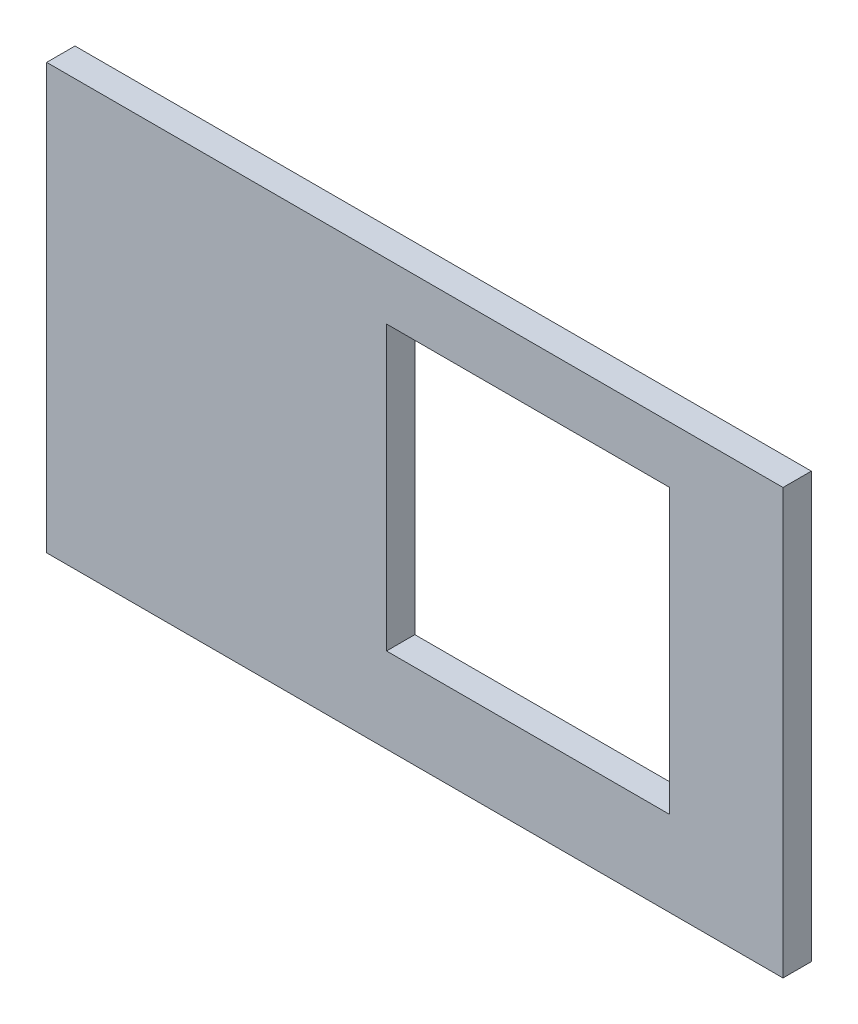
ISO-10303-21;
HEADER;
FILE_DESCRIPTION(('STEP AP214'),'2;1');
FILE_NAME('part.step','',(''),(''),'','','');
FILE_SCHEMA(('AUTOMOTIVE_DESIGN { 1 0 10303 214 1 1 1 1 }'));
ENDSEC;
DATA;
#1=APPLICATION_CONTEXT('core data for automotive mechanical design processes');
#2=APPLICATION_PROTOCOL_DEFINITION('international standard','automotive_design',2000,#1);
#3=PRODUCT_CONTEXT('',#1,'mechanical');
#4=PRODUCT('Part','Part','',(#3));
#5=PRODUCT_RELATED_PRODUCT_CATEGORY('part','',(#4));
#6=PRODUCT_DEFINITION_FORMATION('','',#4);
#7=PRODUCT_DEFINITION_CONTEXT('part definition',#1,'design');
#8=PRODUCT_DEFINITION('design','',#6,#7);
#9=PRODUCT_DEFINITION_SHAPE('','',#8);
#10=(LENGTH_UNIT() NAMED_UNIT(*) SI_UNIT(.MILLI.,.METRE.));
#11=(NAMED_UNIT(*) PLANE_ANGLE_UNIT() SI_UNIT($,.RADIAN.));
#12=(NAMED_UNIT(*) SI_UNIT($,.STERADIAN.) SOLID_ANGLE_UNIT());
#13=UNCERTAINTY_MEASURE_WITH_UNIT(LENGTH_MEASURE(1.E-05),#10,'distance_accuracy_value','');
#14=(GEOMETRIC_REPRESENTATION_CONTEXT(3) GLOBAL_UNCERTAINTY_ASSIGNED_CONTEXT((#13)) GLOBAL_UNIT_ASSIGNED_CONTEXT((#10,
#11,#12)) REPRESENTATION_CONTEXT('',''));
#15=CARTESIAN_POINT('',(0.,0.,0.));
#16=DIRECTION('',(0.,0.,1.));
#17=DIRECTION('',(1.,0.,0.));
#18=AXIS2_PLACEMENT_3D('',#15,#16,#17);
#19=CARTESIAN_POINT('',(0.,30.,2.));
#20=DIRECTION('',(0.,0.,-1.));
#21=DIRECTION('',(-1.,0.,0.));
#22=AXIS2_PLACEMENT_3D('',#19,#20,#21);
#23=PLANE('',#22);
#24=DIRECTION('',(0.,-1.,0.));
#25=VECTOR('',#24,1.);
#26=CARTESIAN_POINT('',(0.,0.,2.));
#27=LINE('',#26,#25);
#28=CARTESIAN_POINT('',(0.,30.,2.));
#29=VERTEX_POINT('',#28);
#30=CARTESIAN_POINT('',(0.,0.,2.));
#31=VERTEX_POINT('',#30);
#32=EDGE_CURVE('E139',#29,#31,#27,.T.);
#33=ORIENTED_EDGE('',*,*,#32,.T.);
#34=DIRECTION('',(1.,0.,0.));
#35=VECTOR('',#34,1.);
#36=CARTESIAN_POINT('',(0.,0.,2.));
#37=LINE('',#36,#35);
#38=CARTESIAN_POINT('',(52.,0.,2.));
#39=VERTEX_POINT('',#38);
#40=EDGE_CURVE('E142',#31,#39,#37,.T.);
#41=ORIENTED_EDGE('',*,*,#40,.T.);
#42=DIRECTION('',(0.,1.,0.));
#43=VECTOR('',#42,1.);
#44=CARTESIAN_POINT('',(52.,0.,2.));
#45=LINE('',#44,#43);
#46=CARTESIAN_POINT('',(52.,30.,2.));
#47=VERTEX_POINT('',#46);
#48=EDGE_CURVE('E144',#39,#47,#45,.T.);
#49=ORIENTED_EDGE('',*,*,#48,.T.);
#50=DIRECTION('',(-1.,0.,0.));
#51=VECTOR('',#50,1.);
#52=CARTESIAN_POINT('',(0.,30.,2.));
#53=LINE('',#52,#51);
#54=EDGE_CURVE('E146',#47,#29,#53,.T.);
#55=ORIENTED_EDGE('',*,*,#54,.T.);
#56=EDGE_LOOP('',(#33,#41,#49,#55));
#57=FACE_BOUND('',#56,.T.);
#58=DIRECTION('',(0.,-1.,0.));
#59=VECTOR('',#58,1.);
#60=CARTESIAN_POINT('',(24.,26.,2.));
#61=LINE('',#60,#59);
#62=CARTESIAN_POINT('',(24.,26.,2.));
#63=VERTEX_POINT('',#62);
#64=CARTESIAN_POINT('',(24.,5.99999999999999,2.));
#65=VERTEX_POINT('',#64);
#66=EDGE_CURVE('E110',#63,#65,#61,.T.);
#67=ORIENTED_EDGE('',*,*,#66,.F.);
#68=DIRECTION('',(-1.,0.,0.));
#69=VECTOR('',#68,1.);
#70=CARTESIAN_POINT('',(24.,26.,2.));
#71=LINE('',#70,#69);
#72=CARTESIAN_POINT('',(44.,26.,2.));
#73=VERTEX_POINT('',#72);
#74=EDGE_CURVE('E125',#73,#63,#71,.T.);
#75=ORIENTED_EDGE('',*,*,#74,.F.);
#76=DIRECTION('',(0.,1.,0.));
#77=VECTOR('',#76,1.);
#78=CARTESIAN_POINT('',(44.,26.,2.));
#79=LINE('',#78,#77);
#80=CARTESIAN_POINT('',(44.,5.99999999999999,2.));
#81=VERTEX_POINT('',#80);
#82=EDGE_CURVE('E123',#81,#73,#79,.T.);
#83=ORIENTED_EDGE('',*,*,#82,.F.);
#84=DIRECTION('',(1.,0.,0.));
#85=VECTOR('',#84,1.);
#86=CARTESIAN_POINT('',(24.,5.99999999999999,2.));
#87=LINE('',#86,#85);
#88=EDGE_CURVE('E121',#65,#81,#87,.T.);
#89=ORIENTED_EDGE('',*,*,#88,.F.);
#90=EDGE_LOOP('',(#67,#75,#83,#89));
#91=FACE_BOUND('',#90,.T.);
#92=ADVANCED_FACE('F30',(#57,#91),#23,.F.);
#93=CARTESIAN_POINT('',(0.,30.,0.));
#94=DIRECTION('',(0.,0.,-1.));
#95=DIRECTION('',(-1.,0.,0.));
#96=AXIS2_PLACEMENT_3D('',#93,#94,#95);
#97=PLANE('',#96);
#98=DIRECTION('',(0.,-1.,0.));
#99=VECTOR('',#98,1.);
#100=CARTESIAN_POINT('',(0.,0.,0.));
#101=LINE('',#100,#99);
#102=CARTESIAN_POINT('',(0.,30.,0.));
#103=VERTEX_POINT('',#102);
#104=CARTESIAN_POINT('',(0.,0.,0.));
#105=VERTEX_POINT('',#104);
#106=EDGE_CURVE('E111',#103,#105,#101,.T.);
#107=ORIENTED_EDGE('',*,*,#106,.F.);
#108=DIRECTION('',(-1.,0.,0.));
#109=VECTOR('',#108,1.);
#110=CARTESIAN_POINT('',(0.,30.,0.));
#111=LINE('',#110,#109);
#112=CARTESIAN_POINT('',(52.,30.,0.));
#113=VERTEX_POINT('',#112);
#114=EDGE_CURVE('E137',#113,#103,#111,.T.);
#115=ORIENTED_EDGE('',*,*,#114,.F.);
#116=DIRECTION('',(0.,1.,0.));
#117=VECTOR('',#116,1.);
#118=CARTESIAN_POINT('',(52.,0.,0.));
#119=LINE('',#118,#117);
#120=CARTESIAN_POINT('',(52.,0.,0.));
#121=VERTEX_POINT('',#120);
#122=EDGE_CURVE('E135',#121,#113,#119,.T.);
#123=ORIENTED_EDGE('',*,*,#122,.F.);
#124=DIRECTION('',(1.,0.,0.));
#125=VECTOR('',#124,1.);
#126=CARTESIAN_POINT('',(0.,0.,0.));
#127=LINE('',#126,#125);
#128=EDGE_CURVE('E133',#105,#121,#127,.T.);
#129=ORIENTED_EDGE('',*,*,#128,.F.);
#130=EDGE_LOOP('',(#107,#115,#123,#129));
#131=FACE_BOUND('',#130,.T.);
#132=DIRECTION('',(-1.,0.,0.));
#133=VECTOR('',#132,1.);
#134=CARTESIAN_POINT('',(24.,26.,0.));
#135=LINE('',#134,#133);
#136=CARTESIAN_POINT('',(44.,26.,0.));
#137=VERTEX_POINT('',#136);
#138=CARTESIAN_POINT('',(24.,26.,0.));
#139=VERTEX_POINT('',#138);
#140=EDGE_CURVE('E115',#137,#139,#135,.T.);
#141=ORIENTED_EDGE('',*,*,#140,.T.);
#142=DIRECTION('',(0.,-1.,0.));
#143=VECTOR('',#142,1.);
#144=CARTESIAN_POINT('',(24.,26.,0.));
#145=LINE('',#144,#143);
#146=CARTESIAN_POINT('',(24.,5.99999999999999,0.));
#147=VERTEX_POINT('',#146);
#148=EDGE_CURVE('E53',#139,#147,#145,.T.);
#149=ORIENTED_EDGE('',*,*,#148,.T.);
#150=DIRECTION('',(1.,0.,0.));
#151=VECTOR('',#150,1.);
#152=CARTESIAN_POINT('',(24.,5.99999999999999,0.));
#153=LINE('',#152,#151);
#154=CARTESIAN_POINT('',(44.,5.99999999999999,0.));
#155=VERTEX_POINT('',#154);
#156=EDGE_CURVE('E97',#147,#155,#153,.T.);
#157=ORIENTED_EDGE('',*,*,#156,.T.);
#158=DIRECTION('',(0.,1.,0.));
#159=VECTOR('',#158,1.);
#160=CARTESIAN_POINT('',(44.,26.,0.));
#161=LINE('',#160,#159);
#162=EDGE_CURVE('E106',#155,#137,#161,.T.);
#163=ORIENTED_EDGE('',*,*,#162,.T.);
#164=EDGE_LOOP('',(#141,#149,#157,#163));
#165=FACE_BOUND('',#164,.T.);
#166=ADVANCED_FACE('F114',(#131,#165),#97,.T.);
#167=CARTESIAN_POINT('',(0.,0.,2.));
#168=DIRECTION('',(1.,0.,0.));
#169=DIRECTION('',(0.,0.,-1.));
#170=AXIS2_PLACEMENT_3D('',#167,#168,#169);
#171=PLANE('',#170);
#172=ORIENTED_EDGE('',*,*,#106,.T.);
#173=DIRECTION('',(0.,0.,-1.));
#174=VECTOR('',#173,1.);
#175=CARTESIAN_POINT('',(0.,0.,2.));
#176=LINE('',#175,#174);
#177=EDGE_CURVE('E11',#31,#105,#176,.T.);
#178=ORIENTED_EDGE('',*,*,#177,.F.);
#179=ORIENTED_EDGE('',*,*,#32,.F.);
#180=DIRECTION('',(0.,0.,-1.));
#181=VECTOR('',#180,1.);
#182=CARTESIAN_POINT('',(0.,30.,2.));
#183=LINE('',#182,#181);
#184=EDGE_CURVE('E148',#29,#103,#183,.T.);
#185=ORIENTED_EDGE('',*,*,#184,.T.);
#186=EDGE_LOOP('',(#172,#178,#179,#185));
#187=FACE_BOUND('',#186,.T.);
#188=ADVANCED_FACE('F32',(#187),#171,.F.);
#189=CARTESIAN_POINT('',(0.,0.,2.));
#190=DIRECTION('',(0.,1.,0.));
#191=DIRECTION('',(0.,0.,1.));
#192=AXIS2_PLACEMENT_3D('',#189,#190,#191);
#193=PLANE('',#192);
#194=ORIENTED_EDGE('',*,*,#128,.T.);
#195=DIRECTION('',(0.,0.,-1.));
#196=VECTOR('',#195,1.);
#197=CARTESIAN_POINT('',(52.,0.,2.));
#198=LINE('',#197,#196);
#199=EDGE_CURVE('E38',#39,#121,#198,.T.);
#200=ORIENTED_EDGE('',*,*,#199,.F.);
#201=ORIENTED_EDGE('',*,*,#40,.F.);
#202=ORIENTED_EDGE('',*,*,#177,.T.);
#203=EDGE_LOOP('',(#194,#200,#201,#202));
#204=FACE_BOUND('',#203,.T.);
#205=ADVANCED_FACE('F173',(#204),#193,.F.);
#206=CARTESIAN_POINT('',(52.,0.,2.));
#207=DIRECTION('',(-1.,0.,0.));
#208=DIRECTION('',(0.,0.,1.));
#209=AXIS2_PLACEMENT_3D('',#206,#207,#208);
#210=PLANE('',#209);
#211=ORIENTED_EDGE('',*,*,#122,.T.);
#212=DIRECTION('',(0.,0.,-1.));
#213=VECTOR('',#212,1.);
#214=CARTESIAN_POINT('',(52.,30.,2.));
#215=LINE('',#214,#213);
#216=EDGE_CURVE('E151',#47,#113,#215,.T.);
#217=ORIENTED_EDGE('',*,*,#216,.F.);
#218=ORIENTED_EDGE('',*,*,#48,.F.);
#219=ORIENTED_EDGE('',*,*,#199,.T.);
#220=EDGE_LOOP('',(#211,#217,#218,#219));
#221=FACE_BOUND('',#220,.T.);
#222=ADVANCED_FACE('F158',(#221),#210,.F.);
#223=CARTESIAN_POINT('',(0.,30.,2.));
#224=DIRECTION('',(0.,-1.,0.));
#225=DIRECTION('',(0.,0.,-1.));
#226=AXIS2_PLACEMENT_3D('',#223,#224,#225);
#227=PLANE('',#226);
#228=ORIENTED_EDGE('',*,*,#114,.T.);
#229=ORIENTED_EDGE('',*,*,#184,.F.);
#230=ORIENTED_EDGE('',*,*,#54,.F.);
#231=ORIENTED_EDGE('',*,*,#216,.T.);
#232=EDGE_LOOP('',(#228,#229,#230,#231));
#233=FACE_BOUND('',#232,.T.);
#234=ADVANCED_FACE('F166',(#233),#227,.F.);
#235=CARTESIAN_POINT('',(24.,26.,2.));
#236=DIRECTION('',(1.,0.,0.));
#237=DIRECTION('',(0.,0.,-1.));
#238=AXIS2_PLACEMENT_3D('',#235,#236,#237);
#239=PLANE('',#238);
#240=ORIENTED_EDGE('',*,*,#148,.F.);
#241=DIRECTION('',(0.,0.,-1.));
#242=VECTOR('',#241,1.);
#243=CARTESIAN_POINT('',(24.,26.,2.));
#244=LINE('',#243,#242);
#245=EDGE_CURVE('E127',#63,#139,#244,.T.);
#246=ORIENTED_EDGE('',*,*,#245,.F.);
#247=ORIENTED_EDGE('',*,*,#66,.T.);
#248=DIRECTION('',(0.,0.,-1.));
#249=VECTOR('',#248,1.);
#250=CARTESIAN_POINT('',(24.,5.99999999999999,2.));
#251=LINE('',#250,#249);
#252=EDGE_CURVE('E99',#65,#147,#251,.T.);
#253=ORIENTED_EDGE('',*,*,#252,.T.);
#254=EDGE_LOOP('',(#240,#246,#247,#253));
#255=FACE_BOUND('',#254,.T.);
#256=ADVANCED_FACE('F108',(#255),#239,.T.);
#257=CARTESIAN_POINT('',(24.,5.99999999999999,2.));
#258=DIRECTION('',(0.,1.,0.));
#259=DIRECTION('',(0.,0.,1.));
#260=AXIS2_PLACEMENT_3D('',#257,#258,#259);
#261=PLANE('',#260);
#262=ORIENTED_EDGE('',*,*,#156,.F.);
#263=ORIENTED_EDGE('',*,*,#252,.F.);
#264=ORIENTED_EDGE('',*,*,#88,.T.);
#265=DIRECTION('',(0.,0.,-1.));
#266=VECTOR('',#265,1.);
#267=CARTESIAN_POINT('',(44.,5.99999999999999,2.));
#268=LINE('',#267,#266);
#269=EDGE_CURVE('E102',#81,#155,#268,.T.);
#270=ORIENTED_EDGE('',*,*,#269,.T.);
#271=EDGE_LOOP('',(#262,#263,#264,#270));
#272=FACE_BOUND('',#271,.T.);
#273=ADVANCED_FACE('F98',(#272),#261,.T.);
#274=CARTESIAN_POINT('',(44.,26.,2.));
#275=DIRECTION('',(-1.,0.,0.));
#276=DIRECTION('',(0.,0.,1.));
#277=AXIS2_PLACEMENT_3D('',#274,#275,#276);
#278=PLANE('',#277);
#279=ORIENTED_EDGE('',*,*,#162,.F.);
#280=ORIENTED_EDGE('',*,*,#269,.F.);
#281=ORIENTED_EDGE('',*,*,#82,.T.);
#282=DIRECTION('',(0.,0.,-1.));
#283=VECTOR('',#282,1.);
#284=CARTESIAN_POINT('',(44.,26.,2.));
#285=LINE('',#284,#283);
#286=EDGE_CURVE('E45',#73,#137,#285,.T.);
#287=ORIENTED_EDGE('',*,*,#286,.T.);
#288=EDGE_LOOP('',(#279,#280,#281,#287));
#289=FACE_BOUND('',#288,.T.);
#290=ADVANCED_FACE('F195',(#289),#278,.T.);
#291=CARTESIAN_POINT('',(24.,26.,2.));
#292=DIRECTION('',(0.,-1.,0.));
#293=DIRECTION('',(0.,0.,-1.));
#294=AXIS2_PLACEMENT_3D('',#291,#292,#293);
#295=PLANE('',#294);
#296=ORIENTED_EDGE('',*,*,#140,.F.);
#297=ORIENTED_EDGE('',*,*,#286,.F.);
#298=ORIENTED_EDGE('',*,*,#74,.T.);
#299=ORIENTED_EDGE('',*,*,#245,.T.);
#300=EDGE_LOOP('',(#296,#297,#298,#299));
#301=FACE_BOUND('',#300,.T.);
#302=ADVANCED_FACE('F200',(#301),#295,.T.);
#303=CLOSED_SHELL('',(#92,#166,#188,#205,#222,#234,#256,#273,#290,#302));
#304=MANIFOLD_SOLID_BREP('B2',#303);
#305=ADVANCED_BREP_SHAPE_REPRESENTATION('',(#18,#304),#14);
#306=SHAPE_DEFINITION_REPRESENTATION(#9,#305);
ENDSEC;
END-ISO-10303-21;
